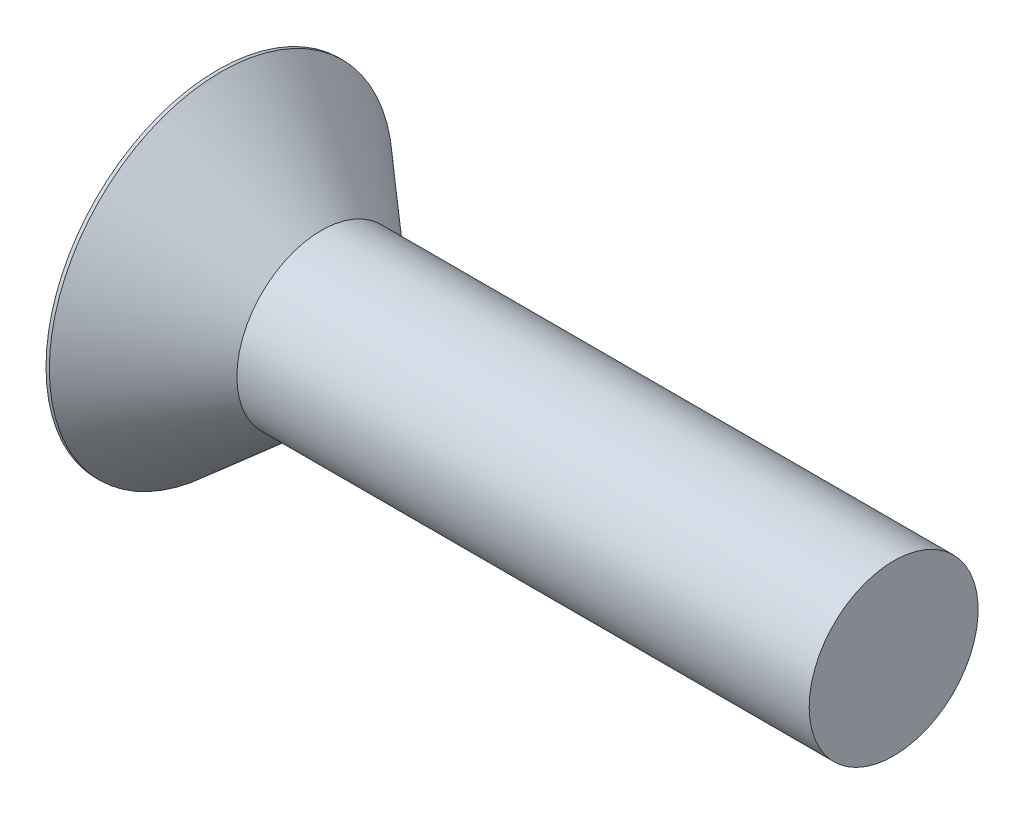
ISO-10303-21;
HEADER;
FILE_DESCRIPTION(('STEP AP214'),'2;1');
FILE_NAME('part.step','',(''),(''),'','','');
FILE_SCHEMA(('AUTOMOTIVE_DESIGN { 1 0 10303 214 1 1 1 1 }'));
ENDSEC;
DATA;
#1=APPLICATION_CONTEXT('core data for automotive mechanical design processes');
#2=APPLICATION_PROTOCOL_DEFINITION('international standard','automotive_design',2000,#1);
#3=PRODUCT_CONTEXT('',#1,'mechanical');
#4=PRODUCT('Part','Part','',(#3));
#5=PRODUCT_RELATED_PRODUCT_CATEGORY('part','',(#4));
#6=PRODUCT_DEFINITION_FORMATION('','',#4);
#7=PRODUCT_DEFINITION_CONTEXT('part definition',#1,'design');
#8=PRODUCT_DEFINITION('design','',#6,#7);
#9=PRODUCT_DEFINITION_SHAPE('','',#8);
#10=(LENGTH_UNIT() NAMED_UNIT(*) SI_UNIT(.MILLI.,.METRE.));
#11=(NAMED_UNIT(*) PLANE_ANGLE_UNIT() SI_UNIT($,.RADIAN.));
#12=(NAMED_UNIT(*) SI_UNIT($,.STERADIAN.) SOLID_ANGLE_UNIT());
#13=UNCERTAINTY_MEASURE_WITH_UNIT(LENGTH_MEASURE(1.E-05),#10,'distance_accuracy_value','');
#14=(GEOMETRIC_REPRESENTATION_CONTEXT(3) GLOBAL_UNCERTAINTY_ASSIGNED_CONTEXT((#13)) GLOBAL_UNIT_ASSIGNED_CONTEXT((#10,
#11,#12)) REPRESENTATION_CONTEXT('',''));
#15=CARTESIAN_POINT('',(0.,0.,0.));
#16=DIRECTION('',(0.,0.,1.));
#17=DIRECTION('',(1.,0.,0.));
#18=AXIS2_PLACEMENT_3D('',#15,#16,#17);
#19=CARTESIAN_POINT('',(0.,0.,0.));
#20=DIRECTION('',(-1.,0.,0.));
#21=DIRECTION('',(0.,0.,1.));
#22=AXIS2_PLACEMENT_3D('',#19,#20,#21);
#23=PLANE('',#22);
#24=CARTESIAN_POINT('',(0.,0.,0.));
#25=DIRECTION('',(-1.,0.,0.));
#26=DIRECTION('',(0.,0.,1.));
#27=AXIS2_PLACEMENT_3D('',#24,#25,#26);
#28=CIRCLE('',#27,9.6774);
#29=CARTESIAN_POINT('',(0.,0.,9.6774));
#30=VERTEX_POINT('',#29);
#31=EDGE_CURVE('E46',#30,#30,#28,.T.);
#32=ORIENTED_EDGE('',*,*,#31,.T.);
#33=EDGE_LOOP('',(#32));
#34=FACE_BOUND('',#33,.T.);
#35=DIRECTION('',(0.,1.,0.));
#36=VECTOR('',#35,1.);
#37=CARTESIAN_POINT('',(0.,-6.6421,-1.0922));
#38=LINE('',#37,#36);
#39=CARTESIAN_POINT('',(0.,-6.6421,-1.0922));
#40=VERTEX_POINT('',#39);
#41=CARTESIAN_POINT('',(0.,-1.0922,-1.0922));
#42=VERTEX_POINT('',#41);
#43=EDGE_CURVE('E107',#40,#42,#38,.T.);
#44=ORIENTED_EDGE('',*,*,#43,.T.);
#45=DIRECTION('',(0.,0.,-1.));
#46=VECTOR('',#45,1.);
#47=CARTESIAN_POINT('',(0.,-1.09220000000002,6.6421));
#48=LINE('',#47,#46);
#49=CARTESIAN_POINT('',(0.,-1.09219999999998,-6.6421));
#50=VERTEX_POINT('',#49);
#51=EDGE_CURVE('E87',#42,#50,#48,.T.);
#52=ORIENTED_EDGE('',*,*,#51,.T.);
#53=DIRECTION('',(0.,1.,0.));
#54=VECTOR('',#53,1.);
#55=CARTESIAN_POINT('',(0.,-1.09219999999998,-6.6421));
#56=LINE('',#55,#54);
#57=CARTESIAN_POINT('',(0.,1.09220000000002,-6.6421));
#58=VERTEX_POINT('',#57);
#59=EDGE_CURVE('E330',#50,#58,#56,.T.);
#60=ORIENTED_EDGE('',*,*,#59,.T.);
#61=DIRECTION('',(0.,0.,1.));
#62=VECTOR('',#61,1.);
#63=CARTESIAN_POINT('',(0.,1.09220000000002,-6.6421));
#64=LINE('',#63,#62);
#65=CARTESIAN_POINT('',(0.,1.0922,-1.0922));
#66=VERTEX_POINT('',#65);
#67=EDGE_CURVE('E103',#58,#66,#64,.T.);
#68=ORIENTED_EDGE('',*,*,#67,.T.);
#69=CARTESIAN_POINT('',(0.,6.6421,-1.0922));
#70=VERTEX_POINT('',#69);
#71=EDGE_CURVE('E97',#66,#70,#38,.T.);
#72=ORIENTED_EDGE('',*,*,#71,.T.);
#73=DIRECTION('',(0.,0.,1.));
#74=VECTOR('',#73,1.);
#75=CARTESIAN_POINT('',(0.,6.6421,-1.0922));
#76=LINE('',#75,#74);
#77=CARTESIAN_POINT('',(0.,6.6421,1.0922));
#78=VERTEX_POINT('',#77);
#79=EDGE_CURVE('E100',#70,#78,#76,.T.);
#80=ORIENTED_EDGE('',*,*,#79,.T.);
#81=DIRECTION('',(0.,-1.,0.));
#82=VECTOR('',#81,1.);
#83=CARTESIAN_POINT('',(0.,6.6421,1.0922));
#84=LINE('',#83,#82);
#85=CARTESIAN_POINT('',(0.,1.0922,1.0922));
#86=VERTEX_POINT('',#85);
#87=EDGE_CURVE('E342',#78,#86,#84,.T.);
#88=ORIENTED_EDGE('',*,*,#87,.T.);
#89=CARTESIAN_POINT('',(0.,1.09219999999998,6.6421));
#90=VERTEX_POINT('',#89);
#91=EDGE_CURVE('E325',#86,#90,#64,.T.);
#92=ORIENTED_EDGE('',*,*,#91,.T.);
#93=DIRECTION('',(0.,-1.,0.));
#94=VECTOR('',#93,1.);
#95=CARTESIAN_POINT('',(0.,1.09219999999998,6.6421));
#96=LINE('',#95,#94);
#97=CARTESIAN_POINT('',(0.,-1.09220000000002,6.6421));
#98=VERTEX_POINT('',#97);
#99=EDGE_CURVE('E311',#90,#98,#96,.T.);
#100=ORIENTED_EDGE('',*,*,#99,.T.);
#101=CARTESIAN_POINT('',(0.,-1.0922,1.0922));
#102=VERTEX_POINT('',#101);
#103=EDGE_CURVE('E323',#98,#102,#48,.T.);
#104=ORIENTED_EDGE('',*,*,#103,.T.);
#105=CARTESIAN_POINT('',(0.,-6.6421,1.0922));
#106=VERTEX_POINT('',#105);
#107=EDGE_CURVE('E113',#102,#106,#84,.T.);
#108=ORIENTED_EDGE('',*,*,#107,.T.);
#109=DIRECTION('',(0.,0.,-1.));
#110=VECTOR('',#109,1.);
#111=CARTESIAN_POINT('',(0.,-6.6421,1.0922));
#112=LINE('',#111,#110);
#113=EDGE_CURVE('E136',#106,#40,#112,.T.);
#114=ORIENTED_EDGE('',*,*,#113,.T.);
#115=EDGE_LOOP('',(#44,#52,#60,#68,#72,#80,#88,#92,#100,#104,#108,#114));
#116=FACE_BOUND('',#115,.T.);
#117=ADVANCED_FACE('F39',(#34,#116),#23,.T.);
#118=CARTESIAN_POINT('',(8.69008083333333,0.,0.497178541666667));
#119=DIRECTION('',(-0.0683113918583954,0.,-0.997664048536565));
#120=DIRECTION('',(-0.997664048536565,0.,0.0683113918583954));
#121=AXIS2_PLACEMENT_3D('',#118,#119,#120);
#122=PLANE('',#121);
#123=ORIENTED_EDGE('',*,*,#107,.F.);
#124=DIRECTION('',(0.995344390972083,0.0681525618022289,-0.0681525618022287));
#125=VECTOR('',#124,1.);
#126=CARTESIAN_POINT('',(8.72380707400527,-0.494869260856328,0.494869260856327));
#127=LINE('',#126,#125);
#128=CARTESIAN_POINT('',(7.9756,-0.546100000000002,0.546099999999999));
#129=VERTEX_POINT('',#128);
#130=EDGE_CURVE('E131',#102,#129,#127,.T.);
#131=ORIENTED_EDGE('',*,*,#130,.T.);
#132=DIRECTION('',(0.793328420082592,0.606365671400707,-0.0543202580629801));
#133=VECTOR('',#132,1.);
#134=CARTESIAN_POINT('',(0.,-6.6421,1.0922));
#135=LINE('',#134,#133);
#136=EDGE_CURVE('E108',#106,#129,#135,.T.);
#137=ORIENTED_EDGE('',*,*,#136,.F.);
#138=EDGE_LOOP('',(#123,#131,#137));
#139=FACE_BOUND('',#138,.T.);
#140=ADVANCED_FACE('F159',(#139),#122,.T.);
#141=DIRECTION('',(0.793328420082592,-0.606365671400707,-0.05432025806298));
#142=VECTOR('',#141,1.);
#143=CARTESIAN_POINT('',(0.,6.6421,1.0922));
#144=LINE('',#143,#142);
#145=CARTESIAN_POINT('',(7.9756,0.546100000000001,0.5461));
#146=VERTEX_POINT('',#145);
#147=EDGE_CURVE('E53',#78,#146,#144,.T.);
#148=ORIENTED_EDGE('',*,*,#147,.T.);
#149=DIRECTION('',(-0.995344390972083,0.0681525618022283,0.0681525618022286));
#150=VECTOR('',#149,1.);
#151=CARTESIAN_POINT('',(8.72380707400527,0.494869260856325,0.494869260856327));
#152=LINE('',#151,#150);
#153=EDGE_CURVE('E338',#146,#86,#152,.T.);
#154=ORIENTED_EDGE('',*,*,#153,.T.);
#155=ORIENTED_EDGE('',*,*,#87,.F.);
#156=EDGE_LOOP('',(#148,#154,#155));
#157=FACE_BOUND('',#156,.T.);
#158=ADVANCED_FACE('F164',(#157),#122,.T.);
#159=CARTESIAN_POINT('',(8.69008083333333,0.,-0.497178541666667));
#160=DIRECTION('',(-0.0683113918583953,0.,0.997664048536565));
#161=DIRECTION('',(0.997664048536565,0.,0.0683113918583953));
#162=AXIS2_PLACEMENT_3D('',#159,#160,#161);
#163=PLANE('',#162);
#164=DIRECTION('',(0.793328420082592,0.606365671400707,0.0543202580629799));
#165=VECTOR('',#164,1.);
#166=CARTESIAN_POINT('',(0.,-6.6421,-1.0922));
#167=LINE('',#166,#165);
#168=CARTESIAN_POINT('',(7.9756,-0.546099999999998,-0.546100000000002));
#169=VERTEX_POINT('',#168);
#170=EDGE_CURVE('E62',#40,#169,#167,.T.);
#171=ORIENTED_EDGE('',*,*,#170,.T.);
#172=DIRECTION('',(-0.995344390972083,-0.0681525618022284,-0.0681525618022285));
#173=VECTOR('',#172,1.);
#174=CARTESIAN_POINT('',(8.72380707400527,-0.494869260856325,-0.494869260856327));
#175=LINE('',#174,#173);
#176=EDGE_CURVE('E11',#169,#42,#175,.T.);
#177=ORIENTED_EDGE('',*,*,#176,.T.);
#178=ORIENTED_EDGE('',*,*,#43,.F.);
#179=EDGE_LOOP('',(#171,#177,#178));
#180=FACE_BOUND('',#179,.T.);
#181=ADVANCED_FACE('F156',(#180),#163,.T.);
#182=ORIENTED_EDGE('',*,*,#71,.F.);
#183=DIRECTION('',(0.995344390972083,-0.0681525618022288,0.0681525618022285));
#184=VECTOR('',#183,1.);
#185=CARTESIAN_POINT('',(8.72380707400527,0.494869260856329,-0.494869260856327));
#186=LINE('',#185,#184);
#187=CARTESIAN_POINT('',(7.9756,0.546100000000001,-0.5461));
#188=VERTEX_POINT('',#187);
#189=EDGE_CURVE('E116',#66,#188,#186,.T.);
#190=ORIENTED_EDGE('',*,*,#189,.T.);
#191=DIRECTION('',(0.793328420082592,-0.606365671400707,0.0543202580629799));
#192=VECTOR('',#191,1.);
#193=CARTESIAN_POINT('',(0.,6.6421,-1.0922));
#194=LINE('',#193,#192);
#195=EDGE_CURVE('E112',#70,#188,#194,.T.);
#196=ORIENTED_EDGE('',*,*,#195,.F.);
#197=EDGE_LOOP('',(#182,#190,#196));
#198=FACE_BOUND('',#197,.T.);
#199=ADVANCED_FACE('F115',(#198),#163,.T.);
#200=CARTESIAN_POINT('',(-6.34999999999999,0.,0.));
#201=DIRECTION('',(-1.,0.,0.));
#202=DIRECTION('',(0.,0.,1.));
#203=AXIS2_PLACEMENT_3D('',#200,#201,#202);
#204=CYLINDRICAL_SURFACE('',#203,9.6774);
#205=CARTESIAN_POINT('',(0.188054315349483,0.,0.));
#206=DIRECTION('',(-1.,0.,0.));
#207=DIRECTION('',(0.,0.,1.));
#208=AXIS2_PLACEMENT_3D('',#205,#206,#207);
#209=CIRCLE('',#208,9.6774);
#210=CARTESIAN_POINT('',(0.188054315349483,0.,9.6774));
#211=VERTEX_POINT('',#210);
#212=EDGE_CURVE('E139',#211,#211,#209,.T.);
#213=ORIENTED_EDGE('',*,*,#212,.T.);
#214=EDGE_LOOP('',(#213));
#215=FACE_BOUND('',#214,.T.);
#216=ORIENTED_EDGE('',*,*,#31,.F.);
#217=EDGE_LOOP('',(#216));
#218=FACE_BOUND('',#217,.T.);
#219=ADVANCED_FACE('F145',(#215,#218),#204,.T.);
#220=CARTESIAN_POINT('',(0.188054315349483,0.,0.));
#221=DIRECTION('',(-1.,0.,0.));
#222=DIRECTION('',(0.,0.,1.));
#223=AXIS2_PLACEMENT_3D('',#220,#221,#222);
#224=CONICAL_SURFACE('',#223,9.6774,0.715584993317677);
#225=CARTESIAN_POINT('',(5.842,0.,0.));
#226=DIRECTION('',(-1.,0.,0.));
#227=DIRECTION('',(0.,0.,1.));
#228=AXIS2_PLACEMENT_3D('',#225,#226,#227);
#229=CIRCLE('',#228,4.7625);
#230=CARTESIAN_POINT('',(5.842,0.,4.7625));
#231=VERTEX_POINT('',#230);
#232=EDGE_CURVE('E135',#231,#231,#229,.T.);
#233=ORIENTED_EDGE('',*,*,#232,.T.);
#234=EDGE_LOOP('',(#233));
#235=FACE_BOUND('',#234,.T.);
#236=ORIENTED_EDGE('',*,*,#212,.F.);
#237=EDGE_LOOP('',(#236));
#238=FACE_BOUND('',#237,.T.);
#239=ADVANCED_FACE('F147',(#235,#238),#224,.T.);
#240=CARTESIAN_POINT('',(-6.34999999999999,0.,0.));
#241=DIRECTION('',(-1.,0.,0.));
#242=DIRECTION('',(0.,0.,1.));
#243=AXIS2_PLACEMENT_3D('',#240,#241,#242);
#244=CYLINDRICAL_SURFACE('',#243,4.7625);
#245=CARTESIAN_POINT('',(38.1,0.,0.));
#246=DIRECTION('',(-1.,0.,0.));
#247=DIRECTION('',(0.,0.,1.));
#248=AXIS2_PLACEMENT_3D('',#245,#246,#247);
#249=CIRCLE('',#248,4.7625);
#250=CARTESIAN_POINT('',(38.1,0.,4.7625));
#251=VERTEX_POINT('',#250);
#252=EDGE_CURVE('E132',#251,#251,#249,.T.);
#253=ORIENTED_EDGE('',*,*,#252,.T.);
#254=EDGE_LOOP('',(#253));
#255=FACE_BOUND('',#254,.T.);
#256=ORIENTED_EDGE('',*,*,#232,.F.);
#257=EDGE_LOOP('',(#256));
#258=FACE_BOUND('',#257,.T.);
#259=ADVANCED_FACE('F152',(#255,#258),#244,.T.);
#260=CARTESIAN_POINT('',(38.1,4.7625,0.));
#261=DIRECTION('',(1.,0.,0.));
#262=DIRECTION('',(0.,0.,-1.));
#263=AXIS2_PLACEMENT_3D('',#260,#261,#262);
#264=PLANE('',#263);
#265=ORIENTED_EDGE('',*,*,#252,.F.);
#266=EDGE_LOOP('',(#265));
#267=FACE_BOUND('',#266,.T.);
#268=ADVANCED_FACE('F184',(#267),#264,.T.);
#269=CARTESIAN_POINT('',(7.9756,0.5461,-0.5461));
#270=DIRECTION('',(1.,0.,0.));
#271=DIRECTION('',(0.,0.,-1.));
#272=AXIS2_PLACEMENT_3D('',#269,#270,#271);
#273=PLANE('',#272);
#274=DIRECTION('',(0.,1.,0.));
#275=VECTOR('',#274,1.);
#276=CARTESIAN_POINT('',(7.9756,-0.5461,-0.5461));
#277=LINE('',#276,#275);
#278=EDGE_CURVE('E127',#169,#188,#277,.T.);
#279=ORIENTED_EDGE('',*,*,#278,.F.);
#280=DIRECTION('',(0.,0.,-1.));
#281=VECTOR('',#280,1.);
#282=CARTESIAN_POINT('',(7.9756,-0.5461,0.5461));
#283=LINE('',#282,#281);
#284=EDGE_CURVE('E118',#129,#169,#283,.T.);
#285=ORIENTED_EDGE('',*,*,#284,.F.);
#286=DIRECTION('',(0.,-1.,0.));
#287=VECTOR('',#286,1.);
#288=CARTESIAN_POINT('',(7.9756,0.5461,0.5461));
#289=LINE('',#288,#287);
#290=EDGE_CURVE('E121',#146,#129,#289,.T.);
#291=ORIENTED_EDGE('',*,*,#290,.F.);
#292=DIRECTION('',(0.,0.,1.));
#293=VECTOR('',#292,1.);
#294=CARTESIAN_POINT('',(7.9756,0.5461,-0.5461));
#295=LINE('',#294,#293);
#296=EDGE_CURVE('E125',#188,#146,#295,.T.);
#297=ORIENTED_EDGE('',*,*,#296,.F.);
#298=EDGE_LOOP('',(#279,#285,#291,#297));
#299=FACE_BOUND('',#298,.T.);
#300=ADVANCED_FACE('F181',(#299),#273,.F.);
#301=CARTESIAN_POINT('',(7.9756,-0.5461,-0.5461));
#302=DIRECTION('',(-0.607262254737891,0.794501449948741,0.));
#303=DIRECTION('',(-0.794501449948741,-0.607262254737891,0.));
#304=AXIS2_PLACEMENT_3D('',#301,#302,#303);
#305=PLANE('',#304);
#306=ORIENTED_EDGE('',*,*,#170,.F.);
#307=ORIENTED_EDGE('',*,*,#113,.F.);
#308=ORIENTED_EDGE('',*,*,#136,.T.);
#309=ORIENTED_EDGE('',*,*,#284,.T.);
#310=EDGE_LOOP('',(#306,#307,#308,#309));
#311=FACE_BOUND('',#310,.T.);
#312=ADVANCED_FACE('F173',(#311),#305,.T.);
#313=CARTESIAN_POINT('',(7.9756,0.5461,0.5461));
#314=DIRECTION('',(-0.607262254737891,-0.794501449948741,0.));
#315=DIRECTION('',(0.794501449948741,-0.607262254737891,0.));
#316=AXIS2_PLACEMENT_3D('',#313,#314,#315);
#317=PLANE('',#316);
#318=ORIENTED_EDGE('',*,*,#147,.F.);
#319=ORIENTED_EDGE('',*,*,#79,.F.);
#320=ORIENTED_EDGE('',*,*,#195,.T.);
#321=ORIENTED_EDGE('',*,*,#296,.T.);
#322=EDGE_LOOP('',(#318,#319,#320,#321));
#323=FACE_BOUND('',#322,.T.);
#324=ADVANCED_FACE('F111',(#323),#317,.T.);
#325=CARTESIAN_POINT('',(8.69008083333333,-0.497178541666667,0.));
#326=DIRECTION('',(-0.0683113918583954,0.997664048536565,0.));
#327=DIRECTION('',(-0.997664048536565,-0.0683113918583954,0.));
#328=AXIS2_PLACEMENT_3D('',#325,#326,#327);
#329=PLANE('',#328);
#330=DIRECTION('',(0.793328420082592,0.054320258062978,0.606365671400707));
#331=VECTOR('',#330,1.);
#332=CARTESIAN_POINT('',(0.,-1.09219999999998,-6.6421));
#333=LINE('',#332,#331);
#334=EDGE_CURVE('E332',#50,#169,#333,.T.);
#335=ORIENTED_EDGE('',*,*,#334,.F.);
#336=ORIENTED_EDGE('',*,*,#51,.F.);
#337=ORIENTED_EDGE('',*,*,#176,.F.);
#338=EDGE_LOOP('',(#335,#336,#337));
#339=FACE_BOUND('',#338,.T.);
#340=ADVANCED_FACE('F180',(#339),#329,.T.);
#341=CARTESIAN_POINT('',(8.69008083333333,0.497178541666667,0.));
#342=DIRECTION('',(-0.0683113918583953,-0.997664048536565,0.));
#343=DIRECTION('',(0.997664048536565,-0.0683113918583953,0.));
#344=AXIS2_PLACEMENT_3D('',#341,#342,#343);
#345=PLANE('',#344);
#346=ORIENTED_EDGE('',*,*,#67,.F.);
#347=DIRECTION('',(0.793328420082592,-0.0543202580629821,0.606365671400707));
#348=VECTOR('',#347,1.);
#349=CARTESIAN_POINT('',(0.,1.09220000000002,-6.6421));
#350=LINE('',#349,#348);
#351=EDGE_CURVE('E78',#58,#188,#350,.T.);
#352=ORIENTED_EDGE('',*,*,#351,.T.);
#353=ORIENTED_EDGE('',*,*,#189,.F.);
#354=EDGE_LOOP('',(#346,#352,#353));
#355=FACE_BOUND('',#354,.T.);
#356=ADVANCED_FACE('F256',(#355),#345,.T.);
#357=CARTESIAN_POINT('',(7.9756,0.546100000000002,-0.546099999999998));
#358=DIRECTION('',(-0.607262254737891,0.,0.794501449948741));
#359=DIRECTION('',(-0.794501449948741,0.,-0.607262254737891));
#360=AXIS2_PLACEMENT_3D('',#357,#358,#359);
#361=PLANE('',#360);
#362=ORIENTED_EDGE('',*,*,#351,.F.);
#363=ORIENTED_EDGE('',*,*,#59,.F.);
#364=ORIENTED_EDGE('',*,*,#334,.T.);
#365=ORIENTED_EDGE('',*,*,#278,.T.);
#366=EDGE_LOOP('',(#362,#363,#364,#365));
#367=FACE_BOUND('',#366,.T.);
#368=ADVANCED_FACE('F266',(#367),#361,.T.);
#369=ORIENTED_EDGE('',*,*,#103,.F.);
#370=DIRECTION('',(0.793328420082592,0.0543202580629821,-0.606365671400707));
#371=VECTOR('',#370,1.);
#372=CARTESIAN_POINT('',(0.,-1.09220000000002,6.6421));
#373=LINE('',#372,#371);
#374=EDGE_CURVE('E308',#98,#129,#373,.T.);
#375=ORIENTED_EDGE('',*,*,#374,.T.);
#376=ORIENTED_EDGE('',*,*,#130,.F.);
#377=EDGE_LOOP('',(#369,#375,#376));
#378=FACE_BOUND('',#377,.T.);
#379=ADVANCED_FACE('F258',(#378),#329,.T.);
#380=DIRECTION('',(0.793328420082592,-0.0543202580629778,-0.606365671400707));
#381=VECTOR('',#380,1.);
#382=CARTESIAN_POINT('',(0.,1.09219999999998,6.6421));
#383=LINE('',#382,#381);
#384=EDGE_CURVE('E319',#90,#146,#383,.T.);
#385=ORIENTED_EDGE('',*,*,#384,.F.);
#386=ORIENTED_EDGE('',*,*,#91,.F.);
#387=ORIENTED_EDGE('',*,*,#153,.F.);
#388=EDGE_LOOP('',(#385,#386,#387));
#389=FACE_BOUND('',#388,.T.);
#390=ADVANCED_FACE('F268',(#389),#345,.T.);
#391=CARTESIAN_POINT('',(7.9756,-0.546100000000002,0.546099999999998));
#392=DIRECTION('',(-0.607262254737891,0.,-0.794501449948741));
#393=DIRECTION('',(0.794501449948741,0.,-0.607262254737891));
#394=AXIS2_PLACEMENT_3D('',#391,#392,#393);
#395=PLANE('',#394);
#396=ORIENTED_EDGE('',*,*,#374,.F.);
#397=ORIENTED_EDGE('',*,*,#99,.F.);
#398=ORIENTED_EDGE('',*,*,#384,.T.);
#399=ORIENTED_EDGE('',*,*,#290,.T.);
#400=EDGE_LOOP('',(#396,#397,#398,#399));
#401=FACE_BOUND('',#400,.T.);
#402=ADVANCED_FACE('F293',(#401),#395,.T.);
#403=CLOSED_SHELL('',(#117,#140,#158,#181,#199,#219,#239,#259,#268,#300,#312,#324,#340,#356,
#368,#379,#390,#402));
#404=MANIFOLD_SOLID_BREP('B2',#403);
#405=ADVANCED_BREP_SHAPE_REPRESENTATION('',(#18,#404),#14);
#406=SHAPE_DEFINITION_REPRESENTATION(#9,#405);
ENDSEC;
END-ISO-10303-21;
